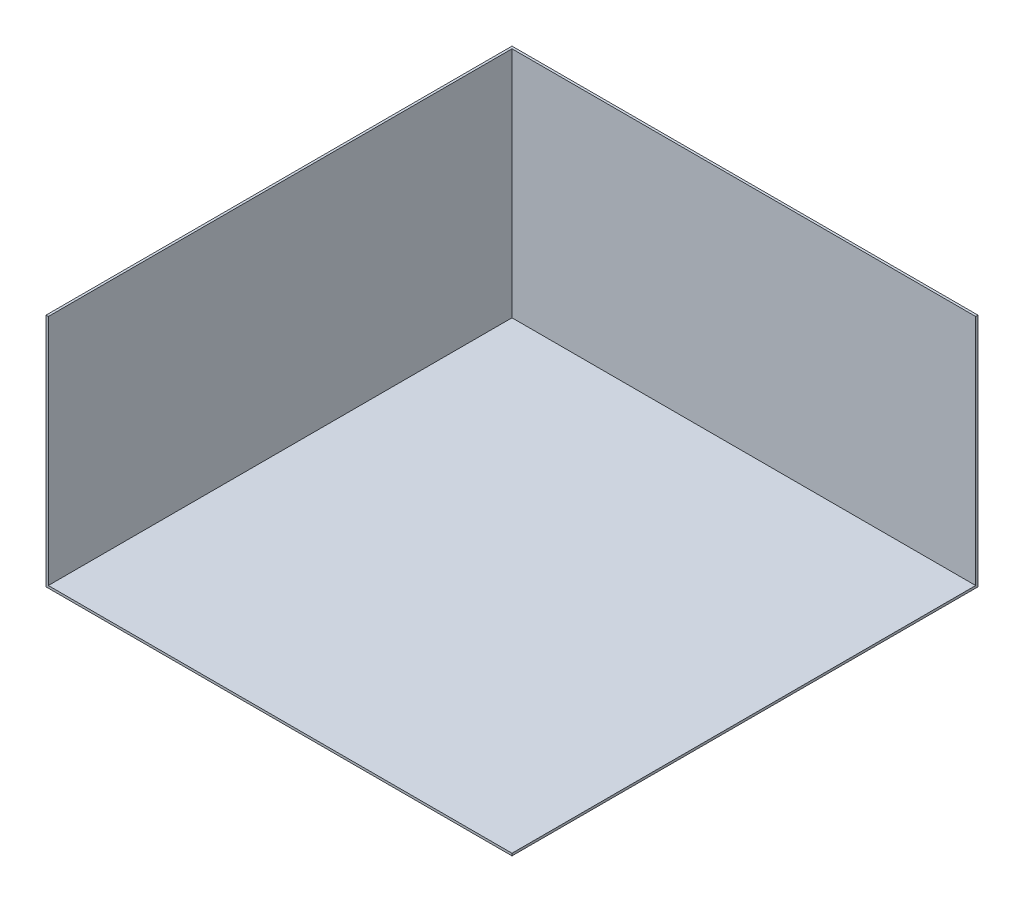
from build123d import *

# Parameters (mm, degrees)
SKETCH1_W           = 5080
SKETCH1_H           = 5080
BOSS_EXTRUDE1_DEPTH = 25.4
SKETCH2_W           = 5054.6
SKETCH2_H           = 25.4
BOSS_EXTRUDE2_DEPTH = 2540


with BuildPart() as part:
    # Sketch1 → Boss-Extrude1 (new body)
    with BuildSketch(Plane(origin=(0, 0, 0), x_dir=(1, 0, 0), z_dir=(0, 1, 0))):
        with Locations((-2540, -2540)):
            Rectangle(SKETCH1_W, SKETCH1_H)
    extrude(amount=BOSS_EXTRUDE1_DEPTH)

    # Sketch2 → Boss-Extrude2 (add)
    with BuildSketch(Plane(origin=(0, 25.4, 0), x_dir=(1, 0, 0), z_dir=(0, 1, 0))):
        Polygon((-5080, 0), (-5080, -5080), (-5054.6, -5080), (-5054.6, -25.4), (-5054.6, 0), align=None)
        with Locations((-2527.3, -12.7)):
            Rectangle(SKETCH2_W, SKETCH2_H)
    extrude(amount=BOSS_EXTRUDE2_DEPTH)


solid = part.part
